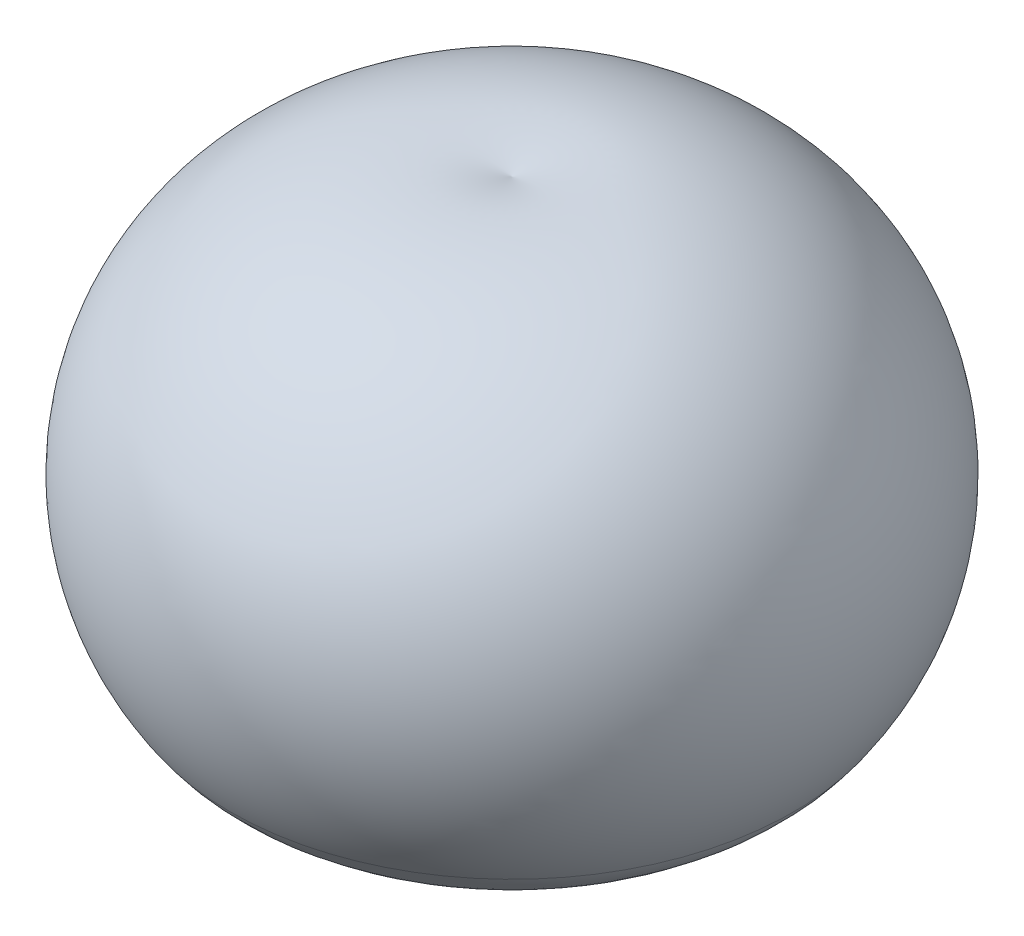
ISO-10303-21;
HEADER;
FILE_DESCRIPTION(('STEP AP214'),'2;1');
FILE_NAME('part.step','',(''),(''),'','','');
FILE_SCHEMA(('AUTOMOTIVE_DESIGN { 1 0 10303 214 1 1 1 1 }'));
ENDSEC;
DATA;
#1=APPLICATION_CONTEXT('core data for automotive mechanical design processes');
#2=APPLICATION_PROTOCOL_DEFINITION('international standard','automotive_design',2000,#1);
#3=PRODUCT_CONTEXT('',#1,'mechanical');
#4=PRODUCT('Part','Part','',(#3));
#5=PRODUCT_RELATED_PRODUCT_CATEGORY('part','',(#4));
#6=PRODUCT_DEFINITION_FORMATION('','',#4);
#7=PRODUCT_DEFINITION_CONTEXT('part definition',#1,'design');
#8=PRODUCT_DEFINITION('design','',#6,#7);
#9=PRODUCT_DEFINITION_SHAPE('','',#8);
#10=(LENGTH_UNIT() NAMED_UNIT(*) SI_UNIT(.MILLI.,.METRE.));
#11=(NAMED_UNIT(*) PLANE_ANGLE_UNIT() SI_UNIT($,.RADIAN.));
#12=(NAMED_UNIT(*) SI_UNIT($,.STERADIAN.) SOLID_ANGLE_UNIT());
#13=UNCERTAINTY_MEASURE_WITH_UNIT(LENGTH_MEASURE(1.E-05),#10,'distance_accuracy_value','');
#14=(GEOMETRIC_REPRESENTATION_CONTEXT(3) GLOBAL_UNCERTAINTY_ASSIGNED_CONTEXT((#13)) GLOBAL_UNIT_ASSIGNED_CONTEXT((#10,
#11,#12)) REPRESENTATION_CONTEXT('',''));
#15=CARTESIAN_POINT('',(0.,0.,0.));
#16=DIRECTION('',(0.,0.,1.));
#17=DIRECTION('',(1.,0.,0.));
#18=AXIS2_PLACEMENT_3D('',#15,#16,#17);
#19=CARTESIAN_POINT('',(0.,980.,344.781847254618));
#20=DIRECTION('',(-1.,0.,0.));
#21=DIRECTION('',(0.,0.,-1.));
#22=AXIS2_PLACEMENT_3D('',#19,#20,#21);
#23=CIRCLE('',#22,790.);
#24=TRIMMED_CURVE('',#23,(PARAMETER_VALUE(-1.11916628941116)),
(PARAMETER_VALUE(1.11916628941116)),.T.,.PARAMETER.);
#25=CARTESIAN_POINT('',(0.,980.,0.));
#26=DIRECTION('',(0.,-1.,0.));
#27=AXIS1_PLACEMENT('',#25,#26);
#28=SURFACE_OF_REVOLUTION('',#24,#27);
#29=CARTESIAN_POINT('',(0.,1690.79214810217,0.));
#30=VERTEX_POINT('',#29);
#31=VERTEX_LOOP('',#30);
#32=FACE_BOUND('',#31,.T.);
#33=CARTESIAN_POINT('',(0.,985.73371122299,0.));
#34=DIRECTION('',(0.,-1.,0.));
#35=DIRECTION('',(0.,0.,-1.));
#36=AXIS2_PLACEMENT_3D('',#33,#34,#35);
#37=CIRCLE('',#36,445.197345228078);
#38=CARTESIAN_POINT('',(0.,985.73371122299,-445.197345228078));
#39=VERTEX_POINT('',#38);
#40=EDGE_CURVE('E37',#39,#39,#37,.T.);
#41=ORIENTED_EDGE('',*,*,#40,.T.);
#42=EDGE_LOOP('',(#41));
#43=FACE_BOUND('',#42,.T.);
#44=ADVANCED_FACE('F16',(#32,#43),#28,.F.);
#45=CARTESIAN_POINT('',(0.,550.,-400.));
#46=DIRECTION('',(-1.,0.,0.));
#47=DIRECTION('',(0.,0.,-1.));
#48=AXIS2_PLACEMENT_3D('',#45,#46,#47);
#49=CIRCLE('',#48,1650.);
#50=TRIMMED_CURVE('',#49,(PARAMETER_VALUE(-1.81566018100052)),
(PARAMETER_VALUE(1.81566018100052)),.T.,.PARAMETER.);
#51=CARTESIAN_POINT('',(0.,550.,0.));
#52=DIRECTION('',(0.,-1.,0.));
#53=AXIS1_PLACEMENT('',#51,#52);
#54=SURFACE_OF_REVOLUTION('',#50,#53);
#55=CARTESIAN_POINT('',(0.,-396.401119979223,0.));
#56=DIRECTION('',(0.,-1.,0.));
#57=DIRECTION('',(0.,0.,-1.));
#58=AXIS2_PLACEMENT_3D('',#55,#56,#57);
#59=CIRCLE('',#58,1751.60087307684);
#60=CARTESIAN_POINT('',(0.,-396.401119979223,-1751.60087307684));
#61=VERTEX_POINT('',#60);
#62=EDGE_CURVE('E11',#61,#61,#59,.T.);
#63=ORIENTED_EDGE('',*,*,#62,.F.);
#64=EDGE_LOOP('',(#63));
#65=FACE_BOUND('',#64,.T.);
#66=CARTESIAN_POINT('',(0.,2150.78105935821,0.));
#67=VERTEX_POINT('',#66);
#68=VERTEX_LOOP('',#67);
#69=FACE_BOUND('',#68,.T.);
#70=ADVANCED_FACE('F34',(#65,#69),#54,.T.);
#71=CARTESIAN_POINT('',(0.,56.7242647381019,0.));
#72=DIRECTION('',(0.,-1.,0.));
#73=DIRECTION('',(0.,0.,-1.));
#74=AXIS2_PLACEMENT_3D('',#71,#72,#73);
#75=TOROIDAL_SURFACE('',#74,1104.47075808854,790.);
#76=CARTESIAN_POINT('',(0.,-218.852458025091,0.));
#77=DIRECTION('',(0.,-1.,0.));
#78=DIRECTION('',(0.,0.,-1.));
#79=AXIS2_PLACEMENT_3D('',#76,#77,#78);
#80=CIRCLE('',#79,364.094185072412);
#81=CARTESIAN_POINT('',(0.,-218.852458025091,-364.094185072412));
#82=VERTEX_POINT('',#81);
#83=EDGE_CURVE('E24',#82,#82,#80,.T.);
#84=ORIENTED_EDGE('',*,*,#83,.F.);
#85=EDGE_LOOP('',(#84));
#86=FACE_BOUND('',#85,.T.);
#87=ORIENTED_EDGE('',*,*,#62,.T.);
#88=EDGE_LOOP('',(#87));
#89=FACE_BOUND('',#88,.T.);
#90=ADVANCED_FACE('F52',(#86,#89),#75,.T.);
#91=CARTESIAN_POINT('',(0.,289.783361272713,0.));
#92=DIRECTION('',(0.,-1.,0.));
#93=DIRECTION('',(0.,0.,-1.));
#94=AXIS2_PLACEMENT_3D('',#91,#92,#93);
#95=DEGENERATE_TOROIDAL_SURFACE('',#94,115.814810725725,565.997389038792,.T.);
#96=CARTESIAN_POINT('',(0.,209.930388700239,0.));
#97=DIRECTION('',(0.,-1.,0.));
#98=DIRECTION('',(0.,0.,-1.));
#99=AXIS2_PLACEMENT_3D('',#96,#97,#98);
#100=CIRCLE('',#99,676.150912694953);
#101=CARTESIAN_POINT('',(0.,209.930388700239,-676.150912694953));
#102=VERTEX_POINT('',#101);
#103=EDGE_CURVE('E40',#102,#102,#100,.T.);
#104=ORIENTED_EDGE('',*,*,#103,.F.);
#105=EDGE_LOOP('',(#104));
#106=FACE_BOUND('',#105,.T.);
#107=ORIENTED_EDGE('',*,*,#83,.T.);
#108=EDGE_LOOP('',(#107));
#109=FACE_BOUND('',#108,.T.);
#110=ADVANCED_FACE('F50',(#106,#109),#95,.F.);
#111=CARTESIAN_POINT('',(0.,550.,0.));
#112=DIRECTION('',(0.,-1.,0.));
#113=DIRECTION('',(0.,0.,-1.));
#114=AXIS2_PLACEMENT_3D('',#111,#112,#113);
#115=DEGENERATE_TOROIDAL_SURFACE('',#114,400.,438.071531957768,.T.);
#116=ORIENTED_EDGE('',*,*,#40,.F.);
#117=EDGE_LOOP('',(#116));
#118=FACE_BOUND('',#117,.T.);
#119=ORIENTED_EDGE('',*,*,#103,.T.);
#120=EDGE_LOOP('',(#119));
#121=FACE_BOUND('',#120,.T.);
#122=ADVANCED_FACE('F65',(#118,#121),#115,.F.);
#123=CLOSED_SHELL('',(#44,#70,#90,#110,#122));
#124=MANIFOLD_SOLID_BREP('B1',#123);
#125=ADVANCED_BREP_SHAPE_REPRESENTATION('',(#18,#124),#14);
#126=SHAPE_DEFINITION_REPRESENTATION(#9,#125);
ENDSEC;
END-ISO-10303-21;
